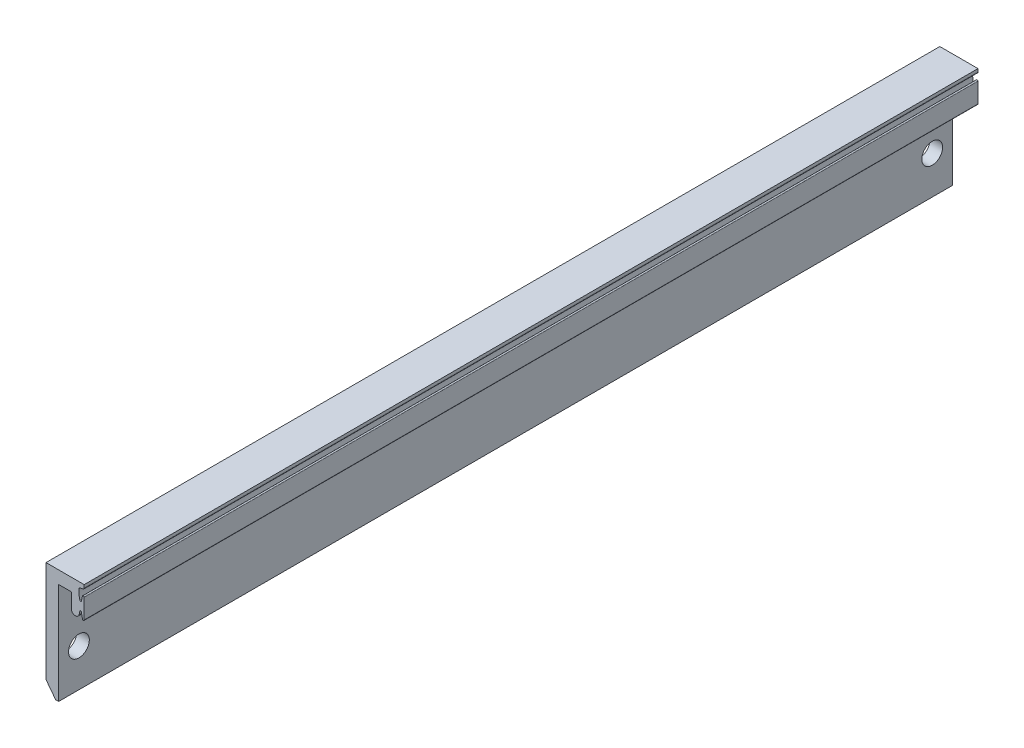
ISO-10303-21;
HEADER;
FILE_DESCRIPTION(('STEP AP214'),'2;1');
FILE_NAME('part.step','',(''),(''),'','','');
FILE_SCHEMA(('AUTOMOTIVE_DESIGN { 1 0 10303 214 1 1 1 1 }'));
ENDSEC;
DATA;
#1=APPLICATION_CONTEXT('core data for automotive mechanical design processes');
#2=APPLICATION_PROTOCOL_DEFINITION('international standard','automotive_design',2000,#1);
#3=PRODUCT_CONTEXT('',#1,'mechanical');
#4=PRODUCT('Part','Part','',(#3));
#5=PRODUCT_RELATED_PRODUCT_CATEGORY('part','',(#4));
#6=PRODUCT_DEFINITION_FORMATION('','',#4);
#7=PRODUCT_DEFINITION_CONTEXT('part definition',#1,'design');
#8=PRODUCT_DEFINITION('design','',#6,#7);
#9=PRODUCT_DEFINITION_SHAPE('','',#8);
#10=(LENGTH_UNIT() NAMED_UNIT(*) SI_UNIT(.MILLI.,.METRE.));
#11=(NAMED_UNIT(*) PLANE_ANGLE_UNIT() SI_UNIT($,.RADIAN.));
#12=(NAMED_UNIT(*) SI_UNIT($,.STERADIAN.) SOLID_ANGLE_UNIT());
#13=UNCERTAINTY_MEASURE_WITH_UNIT(LENGTH_MEASURE(1.E-05),#10,'distance_accuracy_value','');
#14=(GEOMETRIC_REPRESENTATION_CONTEXT(3) GLOBAL_UNCERTAINTY_ASSIGNED_CONTEXT((#13)) GLOBAL_UNIT_ASSIGNED_CONTEXT((#10,
#11,#12)) REPRESENTATION_CONTEXT('',''));
#15=CARTESIAN_POINT('',(0.,0.,0.));
#16=DIRECTION('',(0.,0.,1.));
#17=DIRECTION('',(1.,0.,0.));
#18=AXIS2_PLACEMENT_3D('',#15,#16,#17);
#19=CARTESIAN_POINT('',(2473.35258692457,1.1297441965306E-09,88.225));
#20=DIRECTION('',(1.,4.56766335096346E-13,0.));
#21=DIRECTION('',(-4.56766335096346E-13,1.,0.));
#22=AXIS2_PLACEMENT_3D('',#19,#20,#21);
#23=PLANE('',#22);
#24=DIRECTION('',(4.56766335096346E-13,-1.,0.));
#25=VECTOR('',#24,1.);
#26=CARTESIAN_POINT('',(2473.35258692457,1.1297441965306E-09,-88.225));
#27=LINE('',#26,#25);
#28=CARTESIAN_POINT('',(2473.35258692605,-3238.37710777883,-88.225));
#29=VERTEX_POINT('',#28);
#30=CARTESIAN_POINT('',(2473.35258692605,-3241.29384556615,-88.225));
#31=VERTEX_POINT('',#30);
#32=EDGE_CURVE('E213',#29,#31,#27,.T.);
#33=ORIENTED_EDGE('',*,*,#32,.T.);
#34=DIRECTION('',(0.,0.,-1.));
#35=VECTOR('',#34,1.);
#36=CARTESIAN_POINT('',(2473.35258692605,-3241.29384556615,88.225));
#37=LINE('',#36,#35);
#38=CARTESIAN_POINT('',(2473.35258692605,-3241.29384556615,88.225));
#39=VERTEX_POINT('',#38);
#40=EDGE_CURVE('E11',#39,#31,#37,.T.);
#41=ORIENTED_EDGE('',*,*,#40,.F.);
#42=DIRECTION('',(4.56766335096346E-13,-1.,0.));
#43=VECTOR('',#42,1.);
#44=CARTESIAN_POINT('',(2473.35258692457,1.1297441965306E-09,88.225));
#45=LINE('',#44,#43);
#46=CARTESIAN_POINT('',(2473.35258692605,-3238.37710777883,88.225));
#47=VERTEX_POINT('',#46);
#48=EDGE_CURVE('E267',#47,#39,#45,.T.);
#49=ORIENTED_EDGE('',*,*,#48,.F.);
#50=DIRECTION('',(0.,0.,-1.));
#51=VECTOR('',#50,1.);
#52=CARTESIAN_POINT('',(2473.35258692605,-3238.37710777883,88.225));
#53=LINE('',#52,#51);
#54=EDGE_CURVE('E209',#47,#29,#53,.T.);
#55=ORIENTED_EDGE('',*,*,#54,.T.);
#56=EDGE_LOOP('',(#33,#41,#49,#55));
#57=FACE_BOUND('',#56,.T.);
#58=ADVANCED_FACE('F39',(#57),#23,.F.);
#59=CARTESIAN_POINT('',(2474.13562881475,-3241.29384556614,88.225));
#60=DIRECTION('',(0.,0.,-1.));
#61=DIRECTION('',(-1.,0.,0.));
#62=AXIS2_PLACEMENT_3D('',#59,#60,#61);
#63=CYLINDRICAL_SURFACE('',#62,0.783041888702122);
#64=CARTESIAN_POINT('',(2474.13562881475,-3241.29384556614,-88.225));
#65=DIRECTION('',(0.,0.,1.));
#66=DIRECTION('',(1.,0.,0.));
#67=AXIS2_PLACEMENT_3D('',#64,#65,#66);
#68=CIRCLE('',#67,0.783041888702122);
#69=CARTESIAN_POINT('',(2474.90170185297,-3241.4559773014,-88.225));
#70=VERTEX_POINT('',#69);
#71=EDGE_CURVE('E216',#31,#70,#68,.T.);
#72=ORIENTED_EDGE('',*,*,#71,.T.);
#73=DIRECTION('',(0.,0.,-1.));
#74=VECTOR('',#73,1.);
#75=CARTESIAN_POINT('',(2474.90170185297,-3241.4559773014,88.225));
#76=LINE('',#75,#74);
#77=CARTESIAN_POINT('',(2474.90170185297,-3241.4559773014,88.225));
#78=VERTEX_POINT('',#77);
#79=EDGE_CURVE('E48',#78,#70,#76,.T.);
#80=ORIENTED_EDGE('',*,*,#79,.F.);
#81=CARTESIAN_POINT('',(2474.13562881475,-3241.29384556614,88.225));
#82=DIRECTION('',(0.,0.,1.));
#83=DIRECTION('',(1.,0.,0.));
#84=AXIS2_PLACEMENT_3D('',#81,#82,#83);
#85=CIRCLE('',#84,0.783041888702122);
#86=EDGE_CURVE('E135',#39,#78,#85,.T.);
#87=ORIENTED_EDGE('',*,*,#86,.F.);
#88=ORIENTED_EDGE('',*,*,#40,.T.);
#89=EDGE_LOOP('',(#72,#80,#87,#88));
#90=FACE_BOUND('',#89,.T.);
#91=ADVANCED_FACE('F385',(#90),#63,.T.);
#92=CARTESIAN_POINT('',(3025.41088073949,-640.298106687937,88.225));
#93=DIRECTION('',(-0.978329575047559,0.207053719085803,0.));
#94=DIRECTION('',(-0.207053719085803,-0.978329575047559,0.));
#95=AXIS2_PLACEMENT_3D('',#92,#93,#94);
#96=PLANE('',#95);
#97=DIRECTION('',(0.207053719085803,0.978329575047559,0.));
#98=VECTOR('',#97,1.);
#99=CARTESIAN_POINT('',(3025.41088073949,-640.298106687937,-88.225));
#100=LINE('',#99,#98);
#101=CARTESIAN_POINT('',(2475.03432887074,-3240.82931416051,-88.225));
#102=VERTEX_POINT('',#101);
#103=EDGE_CURVE('E219',#70,#102,#100,.T.);
#104=ORIENTED_EDGE('',*,*,#103,.T.);
#105=DIRECTION('',(0.,0.,-1.));
#106=VECTOR('',#105,1.);
#107=CARTESIAN_POINT('',(2475.03432887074,-3240.82931416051,88.225));
#108=LINE('',#107,#106);
#109=CARTESIAN_POINT('',(2475.03432887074,-3240.82931416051,88.225));
#110=VERTEX_POINT('',#109);
#111=EDGE_CURVE('E303',#110,#102,#108,.T.);
#112=ORIENTED_EDGE('',*,*,#111,.F.);
#113=DIRECTION('',(0.207053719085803,0.978329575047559,0.));
#114=VECTOR('',#113,1.);
#115=CARTESIAN_POINT('',(3025.41088073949,-640.298106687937,88.225));
#116=LINE('',#115,#114);
#117=EDGE_CURVE('E320',#78,#110,#116,.T.);
#118=ORIENTED_EDGE('',*,*,#117,.F.);
#119=ORIENTED_EDGE('',*,*,#79,.T.);
#120=EDGE_LOOP('',(#104,#112,#118,#119));
#121=FACE_BOUND('',#120,.T.);
#122=ADVANCED_FACE('F389',(#121),#96,.F.);
#123=CARTESIAN_POINT('',(2475.18258692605,-3240.85210777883,88.225));
#124=DIRECTION('',(0.,0.,-1.));
#125=DIRECTION('',(-1.,0.,0.));
#126=AXIS2_PLACEMENT_3D('',#123,#124,#125);
#127=CYLINDRICAL_SURFACE('',#126,0.149999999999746);
#128=CARTESIAN_POINT('',(2475.18258692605,-3240.85210777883,-88.225));
#129=DIRECTION('',(0.,0.,1.));
#130=DIRECTION('',(1.,0.,0.));
#131=AXIS2_PLACEMENT_3D('',#128,#129,#130);
#132=CIRCLE('',#131,0.149999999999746);
#133=CARTESIAN_POINT('',(2475.32961411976,-3240.82239239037,-88.225));
#134=VERTEX_POINT('',#133);
#135=EDGE_CURVE('E222',#134,#102,#132,.T.);
#136=ORIENTED_EDGE('',*,*,#135,.F.);
#137=DIRECTION('',(0.,0.,-1.));
#138=VECTOR('',#137,1.);
#139=CARTESIAN_POINT('',(2475.32961411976,-3240.82239239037,88.225));
#140=LINE('',#139,#138);
#141=CARTESIAN_POINT('',(2475.32961411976,-3240.82239239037,88.225));
#142=VERTEX_POINT('',#141);
#143=EDGE_CURVE('E301',#142,#134,#140,.T.);
#144=ORIENTED_EDGE('',*,*,#143,.F.);
#145=CARTESIAN_POINT('',(2475.18258692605,-3240.85210777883,88.225));
#146=DIRECTION('',(0.,0.,1.));
#147=DIRECTION('',(1.,0.,0.));
#148=AXIS2_PLACEMENT_3D('',#145,#146,#147);
#149=CIRCLE('',#148,0.149999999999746);
#150=EDGE_CURVE('E322',#142,#110,#149,.T.);
#151=ORIENTED_EDGE('',*,*,#150,.T.);
#152=ORIENTED_EDGE('',*,*,#111,.T.);
#153=EDGE_LOOP('',(#136,#144,#151,#152));
#154=FACE_BOUND('',#153,.T.);
#155=ADVANCED_FACE('F393',(#154),#127,.F.);
#156=CARTESIAN_POINT('',(1748.89480993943,353.465827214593,88.225));
#157=DIRECTION('',(0.980181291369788,0.19810258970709,0.));
#158=DIRECTION('',(-0.19810258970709,0.980181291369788,0.));
#159=AXIS2_PLACEMENT_3D('',#156,#157,#158);
#160=PLANE('',#159);
#161=DIRECTION('',(0.19810258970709,-0.980181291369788,0.));
#162=VECTOR('',#161,1.);
#163=CARTESIAN_POINT('',(1748.89480993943,353.465827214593,-88.225));
#164=LINE('',#163,#162);
#165=CARTESIAN_POINT('',(2475.55582897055,-3241.94166884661,-88.225));
#166=VERTEX_POINT('',#165);
#167=EDGE_CURVE('E225',#134,#166,#164,.T.);
#168=ORIENTED_EDGE('',*,*,#167,.T.);
#169=DIRECTION('',(0.,0.,-1.));
#170=VECTOR('',#169,1.);
#171=CARTESIAN_POINT('',(2475.55582897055,-3241.94166884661,88.225));
#172=LINE('',#171,#170);
#173=CARTESIAN_POINT('',(2475.55582897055,-3241.94166884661,88.225));
#174=VERTEX_POINT('',#173);
#175=EDGE_CURVE('E298',#174,#166,#172,.T.);
#176=ORIENTED_EDGE('',*,*,#175,.F.);
#177=DIRECTION('',(0.19810258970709,-0.980181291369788,0.));
#178=VECTOR('',#177,1.);
#179=CARTESIAN_POINT('',(1748.89480993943,353.465827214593,88.225));
#180=LINE('',#179,#178);
#181=EDGE_CURVE('E325',#142,#174,#180,.T.);
#182=ORIENTED_EDGE('',*,*,#181,.F.);
#183=ORIENTED_EDGE('',*,*,#143,.T.);
#184=EDGE_LOOP('',(#168,#176,#182,#183));
#185=FACE_BOUND('',#184,.T.);
#186=ADVANCED_FACE('F399',(#185),#160,.F.);
#187=CARTESIAN_POINT('',(2475.72258692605,-3241.90796571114,88.225));
#188=DIRECTION('',(0.,0.,-1.));
#189=DIRECTION('',(-1.,0.,0.));
#190=AXIS2_PLACEMENT_3D('',#187,#188,#189);
#191=CYLINDRICAL_SURFACE('',#190,0.17012970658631);
#192=CARTESIAN_POINT('',(2475.72258692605,-3241.90796571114,-88.225));
#193=DIRECTION('',(0.,0.,1.));
#194=DIRECTION('',(1.,0.,0.));
#195=AXIS2_PLACEMENT_3D('',#192,#193,#194);
#196=CIRCLE('',#195,0.17012970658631);
#197=CARTESIAN_POINT('',(2475.89258692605,-3241.90132364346,-88.225));
#198=VERTEX_POINT('',#197);
#199=EDGE_CURVE('E227',#166,#198,#196,.T.);
#200=ORIENTED_EDGE('',*,*,#199,.T.);
#201=DIRECTION('',(0.,0.,-1.));
#202=VECTOR('',#201,1.);
#203=CARTESIAN_POINT('',(2475.89258692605,-3241.90132364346,88.225));
#204=LINE('',#203,#202);
#205=CARTESIAN_POINT('',(2475.89258692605,-3241.90132364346,88.225));
#206=VERTEX_POINT('',#205);
#207=EDGE_CURVE('E296',#206,#198,#204,.T.);
#208=ORIENTED_EDGE('',*,*,#207,.F.);
#209=CARTESIAN_POINT('',(2475.72258692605,-3241.90796571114,88.225));
#210=DIRECTION('',(0.,0.,1.));
#211=DIRECTION('',(1.,0.,0.));
#212=AXIS2_PLACEMENT_3D('',#209,#210,#211);
#213=CIRCLE('',#212,0.17012970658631);
#214=EDGE_CURVE('E327',#174,#206,#213,.T.);
#215=ORIENTED_EDGE('',*,*,#214,.F.);
#216=ORIENTED_EDGE('',*,*,#175,.T.);
#217=EDGE_LOOP('',(#200,#208,#215,#216));
#218=FACE_BOUND('',#217,.T.);
#219=ADVANCED_FACE('F403',(#218),#191,.T.);
#220=CARTESIAN_POINT('',(2475.89258692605,0.,88.225));
#221=DIRECTION('',(1.,0.,0.));
#222=DIRECTION('',(0.,0.,-1.));
#223=AXIS2_PLACEMENT_3D('',#220,#221,#222);
#224=PLANE('',#223);
#225=DIRECTION('',(0.,-1.,0.));
#226=VECTOR('',#225,1.);
#227=CARTESIAN_POINT('',(2475.89258692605,0.,-88.225));
#228=LINE('',#227,#226);
#229=CARTESIAN_POINT('',(2475.89258692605,-3238.03960777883,-88.225));
#230=VERTEX_POINT('',#229);
#231=EDGE_CURVE('E230',#230,#198,#228,.T.);
#232=ORIENTED_EDGE('',*,*,#231,.F.);
#233=DIRECTION('',(0.,0.,-1.));
#234=VECTOR('',#233,1.);
#235=CARTESIAN_POINT('',(2475.89258692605,-3238.03960777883,88.225));
#236=LINE('',#235,#234);
#237=CARTESIAN_POINT('',(2475.89258692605,-3238.03960777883,88.225));
#238=VERTEX_POINT('',#237);
#239=EDGE_CURVE('E294',#238,#230,#236,.T.);
#240=ORIENTED_EDGE('',*,*,#239,.F.);
#241=DIRECTION('',(0.,-1.,0.));
#242=VECTOR('',#241,1.);
#243=CARTESIAN_POINT('',(2475.89258692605,0.,88.225));
#244=LINE('',#243,#242);
#245=EDGE_CURVE('E329',#238,#206,#244,.T.);
#246=ORIENTED_EDGE('',*,*,#245,.T.);
#247=ORIENTED_EDGE('',*,*,#207,.T.);
#248=EDGE_LOOP('',(#232,#240,#246,#247));
#249=FACE_BOUND('',#248,.T.);
#250=ADVANCED_FACE('F407',(#249),#224,.T.);
#251=CARTESIAN_POINT('',(2475.72258692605,-3238.04624984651,88.225));
#252=DIRECTION('',(0.,0.,-1.));
#253=DIRECTION('',(-1.,0.,0.));
#254=AXIS2_PLACEMENT_3D('',#251,#252,#253);
#255=CYLINDRICAL_SURFACE('',#254,0.17012970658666);
#256=CARTESIAN_POINT('',(2475.72258692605,-3238.04624984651,-88.225));
#257=DIRECTION('',(0.,0.,1.));
#258=DIRECTION('',(1.,0.,0.));
#259=AXIS2_PLACEMENT_3D('',#256,#257,#258);
#260=CIRCLE('',#259,0.17012970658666);
#261=CARTESIAN_POINT('',(2475.55690402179,-3238.00760670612,-88.225));
#262=VERTEX_POINT('',#261);
#263=EDGE_CURVE('E233',#230,#262,#260,.T.);
#264=ORIENTED_EDGE('',*,*,#263,.T.);
#265=DIRECTION('',(0.,0.,-1.));
#266=VECTOR('',#265,1.);
#267=CARTESIAN_POINT('',(2475.55690402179,-3238.00760670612,88.225));
#268=LINE('',#267,#266);
#269=CARTESIAN_POINT('',(2475.55690402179,-3238.00760670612,88.225));
#270=VERTEX_POINT('',#269);
#271=EDGE_CURVE('E291',#270,#262,#268,.T.);
#272=ORIENTED_EDGE('',*,*,#271,.F.);
#273=CARTESIAN_POINT('',(2475.72258692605,-3238.04624984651,88.225));
#274=DIRECTION('',(0.,0.,1.));
#275=DIRECTION('',(1.,0.,0.));
#276=AXIS2_PLACEMENT_3D('',#273,#274,#275);
#277=CIRCLE('',#276,0.17012970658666);
#278=EDGE_CURVE('E332',#238,#270,#277,.T.);
#279=ORIENTED_EDGE('',*,*,#278,.F.);
#280=ORIENTED_EDGE('',*,*,#239,.T.);
#281=EDGE_LOOP('',(#264,#272,#279,#280));
#282=FACE_BOUND('',#281,.T.);
#283=ADVANCED_FACE('F411',(#282),#255,.T.);
#284=CARTESIAN_POINT('',(3064.09234392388,-714.655209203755,88.225));
#285=DIRECTION('',(0.973862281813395,-0.227139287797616,0.));
#286=DIRECTION('',(0.227139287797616,0.973862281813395,0.));
#287=AXIS2_PLACEMENT_3D('',#284,#285,#286);
#288=PLANE('',#287);
#289=DIRECTION('',(-0.227139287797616,-0.973862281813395,0.));
#290=VECTOR('',#289,1.);
#291=CARTESIAN_POINT('',(3064.09234392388,-714.655209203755,-88.225));
#292=LINE('',#291,#290);
#293=CARTESIAN_POINT('',(2475.32866626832,-3238.986178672,-88.225));
#294=VERTEX_POINT('',#293);
#295=EDGE_CURVE('E235',#262,#294,#292,.T.);
#296=ORIENTED_EDGE('',*,*,#295,.T.);
#297=DIRECTION('',(0.,0.,-1.));
#298=VECTOR('',#297,1.);
#299=CARTESIAN_POINT('',(2475.32866626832,-3238.986178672,88.225));
#300=LINE('',#299,#298);
#301=CARTESIAN_POINT('',(2475.32866626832,-3238.986178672,88.225));
#302=VERTEX_POINT('',#301);
#303=EDGE_CURVE('E289',#302,#294,#300,.T.);
#304=ORIENTED_EDGE('',*,*,#303,.F.);
#305=DIRECTION('',(-0.227139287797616,-0.973862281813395,0.));
#306=VECTOR('',#305,1.);
#307=CARTESIAN_POINT('',(3064.09234392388,-714.655209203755,88.225));
#308=LINE('',#307,#306);
#309=EDGE_CURVE('E334',#270,#302,#308,.T.);
#310=ORIENTED_EDGE('',*,*,#309,.F.);
#311=ORIENTED_EDGE('',*,*,#271,.T.);
#312=EDGE_LOOP('',(#296,#304,#310,#311));
#313=FACE_BOUND('',#312,.T.);
#314=ADVANCED_FACE('F415',(#313),#288,.F.);
#315=CARTESIAN_POINT('',(2475.18258692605,-3238.95210777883,88.225));
#316=DIRECTION('',(0.,0.,-1.));
#317=DIRECTION('',(-1.,0.,0.));
#318=AXIS2_PLACEMENT_3D('',#315,#316,#317);
#319=CYLINDRICAL_SURFACE('',#318,0.150000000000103);
#320=CARTESIAN_POINT('',(2475.18258692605,-3238.95210777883,-88.225));
#321=DIRECTION('',(0.,0.,1.));
#322=DIRECTION('',(1.,0.,0.));
#323=AXIS2_PLACEMENT_3D('',#320,#321,#322);
#324=CIRCLE('',#323,0.150000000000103);
#325=CARTESIAN_POINT('',(2475.03361058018,-3238.96960201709,-88.225));
#326=VERTEX_POINT('',#325);
#327=EDGE_CURVE('E238',#326,#294,#324,.T.);
#328=ORIENTED_EDGE('',*,*,#327,.F.);
#329=DIRECTION('',(0.,0.,-1.));
#330=VECTOR('',#329,1.);
#331=CARTESIAN_POINT('',(2475.03361058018,-3238.96960201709,88.225));
#332=LINE('',#331,#330);
#333=CARTESIAN_POINT('',(2475.03361058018,-3238.96960201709,88.225));
#334=VERTEX_POINT('',#333);
#335=EDGE_CURVE('E287',#334,#326,#332,.T.);
#336=ORIENTED_EDGE('',*,*,#335,.F.);
#337=CARTESIAN_POINT('',(2475.18258692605,-3238.95210777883,88.225));
#338=DIRECTION('',(0.,0.,1.));
#339=DIRECTION('',(1.,0.,0.));
#340=AXIS2_PLACEMENT_3D('',#337,#338,#339);
#341=CIRCLE('',#340,0.150000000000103);
#342=EDGE_CURVE('E336',#334,#302,#341,.T.);
#343=ORIENTED_EDGE('',*,*,#342,.T.);
#344=ORIENTED_EDGE('',*,*,#303,.T.);
#345=EDGE_LOOP('',(#328,#336,#343,#344));
#346=FACE_BOUND('',#345,.T.);
#347=ADVANCED_FACE('F419',(#346),#319,.F.);
#348=CARTESIAN_POINT('',(2481.28067168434,-3237.37963252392,88.225));
#349=DIRECTION('',(0.,0.,-1.));
#350=DIRECTION('',(-1.,0.,0.));
#351=AXIS2_PLACEMENT_3D('',#348,#349,#350);
#352=CYLINDRICAL_SURFACE('',#351,6.44622179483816);
#353=CARTESIAN_POINT('',(2481.28067168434,-3237.37963252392,-88.225));
#354=DIRECTION('',(0.,0.,1.));
#355=DIRECTION('',(1.,0.,0.));
#356=AXIS2_PLACEMENT_3D('',#353,#354,#355);
#357=CIRCLE('',#356,6.44622179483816);
#358=CARTESIAN_POINT('',(2474.83964363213,-3237.12091828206,-88.225));
#359=VERTEX_POINT('',#358);
#360=EDGE_CURVE('E241',#359,#326,#357,.T.);
#361=ORIENTED_EDGE('',*,*,#360,.F.);
#362=DIRECTION('',(0.,0.,-1.));
#363=VECTOR('',#362,1.);
#364=CARTESIAN_POINT('',(2474.83964363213,-3237.12091828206,88.225));
#365=LINE('',#364,#363);
#366=CARTESIAN_POINT('',(2474.83964363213,-3237.12091828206,88.225));
#367=VERTEX_POINT('',#366);
#368=EDGE_CURVE('E285',#367,#359,#365,.T.);
#369=ORIENTED_EDGE('',*,*,#368,.F.);
#370=CARTESIAN_POINT('',(2481.28067168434,-3237.37963252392,88.225));
#371=DIRECTION('',(0.,0.,1.));
#372=DIRECTION('',(1.,0.,0.));
#373=AXIS2_PLACEMENT_3D('',#370,#371,#372);
#374=CIRCLE('',#373,6.44622179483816);
#375=EDGE_CURVE('E339',#367,#334,#374,.T.);
#376=ORIENTED_EDGE('',*,*,#375,.T.);
#377=ORIENTED_EDGE('',*,*,#335,.T.);
#378=EDGE_LOOP('',(#361,#369,#376,#377));
#379=FACE_BOUND('',#378,.T.);
#380=ADVANCED_FACE('F423',(#379),#352,.F.);
#381=CARTESIAN_POINT('',(2475.13940192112,-3237.13295855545,88.225));
#382=DIRECTION('',(0.,0.,-1.));
#383=DIRECTION('',(-1.,0.,0.));
#384=AXIS2_PLACEMENT_3D('',#381,#382,#383);
#385=CYLINDRICAL_SURFACE('',#384,0.299999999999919);
#386=CARTESIAN_POINT('',(2475.13940192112,-3237.13295855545,-88.225));
#387=DIRECTION('',(0.,0.,1.));
#388=DIRECTION('',(1.,0.,0.));
#389=AXIS2_PLACEMENT_3D('',#386,#387,#388);
#390=CIRCLE('',#389,0.299999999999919);
#391=CARTESIAN_POINT('',(2475.09145484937,-3236.83681487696,-88.225));
#392=VERTEX_POINT('',#391);
#393=EDGE_CURVE('E244',#392,#359,#390,.T.);
#394=ORIENTED_EDGE('',*,*,#393,.F.);
#395=DIRECTION('',(0.,0.,-1.));
#396=VECTOR('',#395,1.);
#397=CARTESIAN_POINT('',(2475.09145484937,-3236.83681487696,88.225));
#398=LINE('',#397,#396);
#399=CARTESIAN_POINT('',(2475.09145484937,-3236.83681487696,88.225));
#400=VERTEX_POINT('',#399);
#401=EDGE_CURVE('E283',#400,#392,#398,.T.);
#402=ORIENTED_EDGE('',*,*,#401,.F.);
#403=CARTESIAN_POINT('',(2475.13940192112,-3237.13295855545,88.225));
#404=DIRECTION('',(0.,0.,1.));
#405=DIRECTION('',(1.,0.,0.));
#406=AXIS2_PLACEMENT_3D('',#403,#404,#405);
#407=CIRCLE('',#406,0.299999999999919);
#408=EDGE_CURVE('E342',#400,#367,#407,.T.);
#409=ORIENTED_EDGE('',*,*,#408,.T.);
#410=ORIENTED_EDGE('',*,*,#368,.T.);
#411=EDGE_LOOP('',(#394,#402,#409,#410));
#412=FACE_BOUND('',#411,.T.);
#413=ADVANCED_FACE('F427',(#412),#385,.F.);
#414=CARTESIAN_POINT('',(573.895628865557,-3544.64947241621,88.225));
#415=DIRECTION('',(-0.159823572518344,0.987145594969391,0.));
#416=DIRECTION('',(-0.987145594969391,-0.159823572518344,0.));
#417=AXIS2_PLACEMENT_3D('',#414,#415,#416);
#418=PLANE('',#417);
#419=DIRECTION('',(0.987145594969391,0.159823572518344,0.));
#420=VECTOR('',#419,1.);
#421=CARTESIAN_POINT('',(573.895628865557,-3544.64947241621,-88.225));
#422=LINE('',#421,#420);
#423=CARTESIAN_POINT('',(2475.64053399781,-3236.74791634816,-88.225));
#424=VERTEX_POINT('',#423);
#425=EDGE_CURVE('E247',#392,#424,#422,.T.);
#426=ORIENTED_EDGE('',*,*,#425,.T.);
#427=DIRECTION('',(0.,0.,-1.));
#428=VECTOR('',#427,1.);
#429=CARTESIAN_POINT('',(2475.64053399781,-3236.74791634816,88.225));
#430=LINE('',#429,#428);
#431=CARTESIAN_POINT('',(2475.64053399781,-3236.74791634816,88.225));
#432=VERTEX_POINT('',#431);
#433=EDGE_CURVE('E280',#432,#424,#430,.T.);
#434=ORIENTED_EDGE('',*,*,#433,.F.);
#435=DIRECTION('',(0.987145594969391,0.159823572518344,0.));
#436=VECTOR('',#435,1.);
#437=CARTESIAN_POINT('',(573.895628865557,-3544.64947241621,88.225));
#438=LINE('',#437,#436);
#439=EDGE_CURVE('E345',#400,#432,#438,.T.);
#440=ORIENTED_EDGE('',*,*,#439,.F.);
#441=ORIENTED_EDGE('',*,*,#401,.T.);
#442=EDGE_LOOP('',(#426,#434,#440,#441));
#443=FACE_BOUND('',#442,.T.);
#444=ADVANCED_FACE('F431',(#443),#418,.F.);
#445=CARTESIAN_POINT('',(2475.59258692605,-3236.45177266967,88.225));
#446=DIRECTION('',(0.,0.,-1.));
#447=DIRECTION('',(-1.,0.,0.));
#448=AXIS2_PLACEMENT_3D('',#445,#446,#447);
#449=CYLINDRICAL_SURFACE('',#448,0.299999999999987);
#450=CARTESIAN_POINT('',(2475.59258692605,-3236.45177266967,-88.225));
#451=DIRECTION('',(0.,0.,1.));
#452=DIRECTION('',(1.,0.,0.));
#453=AXIS2_PLACEMENT_3D('',#450,#451,#452);
#454=CIRCLE('',#453,0.299999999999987);
#455=CARTESIAN_POINT('',(2475.89258692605,-3236.45177266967,-88.225));
#456=VERTEX_POINT('',#455);
#457=EDGE_CURVE('E249',#424,#456,#454,.T.);
#458=ORIENTED_EDGE('',*,*,#457,.T.);
#459=DIRECTION('',(0.,0.,-1.));
#460=VECTOR('',#459,1.);
#461=CARTESIAN_POINT('',(2475.89258692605,-3236.45177266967,88.225));
#462=LINE('',#461,#460);
#463=CARTESIAN_POINT('',(2475.89258692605,-3236.45177266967,88.225));
#464=VERTEX_POINT('',#463);
#465=EDGE_CURVE('E278',#464,#456,#462,.T.);
#466=ORIENTED_EDGE('',*,*,#465,.F.);
#467=CARTESIAN_POINT('',(2475.59258692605,-3236.45177266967,88.225));
#468=DIRECTION('',(0.,0.,1.));
#469=DIRECTION('',(1.,0.,0.));
#470=AXIS2_PLACEMENT_3D('',#467,#468,#469);
#471=CIRCLE('',#470,0.299999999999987);
#472=EDGE_CURVE('E347',#432,#464,#471,.T.);
#473=ORIENTED_EDGE('',*,*,#472,.F.);
#474=ORIENTED_EDGE('',*,*,#433,.T.);
#475=EDGE_LOOP('',(#458,#466,#473,#474));
#476=FACE_BOUND('',#475,.T.);
#477=ADVANCED_FACE('F435',(#476),#449,.T.);
#478=CARTESIAN_POINT('',(2475.89258693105,-3.82663775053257E-09,88.225));
#479=DIRECTION('',(1.,-1.54555887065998E-12,0.));
#480=DIRECTION('',(1.54555887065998E-12,1.,0.));
#481=AXIS2_PLACEMENT_3D('',#478,#479,#480);
#482=PLANE('',#481);
#483=DIRECTION('',(-1.54555887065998E-12,-1.,0.));
#484=VECTOR('',#483,1.);
#485=CARTESIAN_POINT('',(2475.89258693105,-3.82663775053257E-09,-88.225));
#486=LINE('',#485,#484);
#487=CARTESIAN_POINT('',(2475.89258692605,-3235.87710777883,-88.225));
#488=VERTEX_POINT('',#487);
#489=EDGE_CURVE('E252',#488,#456,#486,.T.);
#490=ORIENTED_EDGE('',*,*,#489,.F.);
#491=DIRECTION('',(0.,0.,-1.));
#492=VECTOR('',#491,1.);
#493=CARTESIAN_POINT('',(2475.89258692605,-3235.87710777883,88.225));
#494=LINE('',#493,#492);
#495=CARTESIAN_POINT('',(2475.89258692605,-3235.87710777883,88.225));
#496=VERTEX_POINT('',#495);
#497=EDGE_CURVE('E276',#496,#488,#494,.T.);
#498=ORIENTED_EDGE('',*,*,#497,.F.);
#499=DIRECTION('',(-1.54555887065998E-12,-1.,0.));
#500=VECTOR('',#499,1.);
#501=CARTESIAN_POINT('',(2475.89258693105,-3.82663775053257E-09,88.225));
#502=LINE('',#501,#500);
#503=EDGE_CURVE('E349',#496,#464,#502,.T.);
#504=ORIENTED_EDGE('',*,*,#503,.T.);
#505=ORIENTED_EDGE('',*,*,#465,.T.);
#506=EDGE_LOOP('',(#490,#498,#504,#505));
#507=FACE_BOUND('',#506,.T.);
#508=ADVANCED_FACE('F439',(#507),#482,.T.);
#509=CARTESIAN_POINT('',(0.,-3235.87710777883,88.225));
#510=DIRECTION('',(0.,1.,0.));
#511=DIRECTION('',(0.,0.,1.));
#512=AXIS2_PLACEMENT_3D('',#509,#510,#511);
#513=PLANE('',#512);
#514=DIRECTION('',(1.,0.,0.));
#515=VECTOR('',#514,1.);
#516=CARTESIAN_POINT('',(0.,-3235.87710777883,-88.225));
#517=LINE('',#516,#515);
#518=CARTESIAN_POINT('',(2468.35258692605,-3235.87710777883,-88.225));
#519=VERTEX_POINT('',#518);
#520=EDGE_CURVE('E255',#519,#488,#517,.T.);
#521=ORIENTED_EDGE('',*,*,#520,.F.);
#522=DIRECTION('',(0.,0.,-1.));
#523=VECTOR('',#522,1.);
#524=CARTESIAN_POINT('',(2468.35258692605,-3235.87710777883,88.225));
#525=LINE('',#524,#523);
#526=CARTESIAN_POINT('',(2468.35258692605,-3235.87710777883,88.225));
#527=VERTEX_POINT('',#526);
#528=EDGE_CURVE('E274',#527,#519,#525,.T.);
#529=ORIENTED_EDGE('',*,*,#528,.F.);
#530=DIRECTION('',(1.,0.,0.));
#531=VECTOR('',#530,1.);
#532=CARTESIAN_POINT('',(0.,-3235.87710777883,88.225));
#533=LINE('',#532,#531);
#534=EDGE_CURVE('E352',#527,#496,#533,.T.);
#535=ORIENTED_EDGE('',*,*,#534,.T.);
#536=ORIENTED_EDGE('',*,*,#497,.T.);
#537=EDGE_LOOP('',(#521,#529,#535,#536));
#538=FACE_BOUND('',#537,.T.);
#539=ADVANCED_FACE('F443',(#538),#513,.T.);
#540=CARTESIAN_POINT('',(2468.35258692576,2.19233749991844E-10,88.225));
#541=DIRECTION('',(1.,0.,0.));
#542=DIRECTION('',(0.,1.,0.));
#543=AXIS2_PLACEMENT_3D('',#540,#541,#542);
#544=PLANE('',#543);
#545=CARTESIAN_POINT('',(2468.35258692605,-3250.87710777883,84.225));
#546=DIRECTION('',(-1.,0.,0.));
#547=DIRECTION('',(0.,1.,0.));
#548=AXIS2_PLACEMENT_3D('',#545,#546,#547);
#549=CIRCLE('',#548,2.04999999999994);
#550=CARTESIAN_POINT('',(2468.35258692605,-3248.82710777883,84.225));
#551=VERTEX_POINT('',#550);
#552=EDGE_CURVE('E315',#551,#551,#549,.T.);
#553=ORIENTED_EDGE('',*,*,#552,.F.);
#554=EDGE_LOOP('',(#553));
#555=FACE_BOUND('',#554,.T.);
#556=CARTESIAN_POINT('',(2468.35258692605,-3250.87710777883,-84.225));
#557=DIRECTION('',(-1.,0.,0.));
#558=DIRECTION('',(0.,-1.,0.));
#559=AXIS2_PLACEMENT_3D('',#556,#557,#558);
#560=CIRCLE('',#559,2.04999999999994);
#561=CARTESIAN_POINT('',(2468.35258692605,-3252.92710777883,-84.225));
#562=VERTEX_POINT('',#561);
#563=EDGE_CURVE('E307',#562,#562,#560,.T.);
#564=ORIENTED_EDGE('',*,*,#563,.F.);
#565=EDGE_LOOP('',(#564));
#566=FACE_BOUND('',#565,.T.);
#567=DIRECTION('',(0.,-1.,0.));
#568=VECTOR('',#567,1.);
#569=CARTESIAN_POINT('',(2468.35258692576,2.19233749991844E-10,-88.225));
#570=LINE('',#569,#568);
#571=CARTESIAN_POINT('',(2468.35258692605,-3255.87710777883,-88.225));
#572=VERTEX_POINT('',#571);
#573=EDGE_CURVE('E258',#519,#572,#570,.T.);
#574=ORIENTED_EDGE('',*,*,#573,.T.);
#575=DIRECTION('',(0.,0.,-1.));
#576=VECTOR('',#575,1.);
#577=CARTESIAN_POINT('',(2468.35258692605,-3255.87710777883,88.225));
#578=LINE('',#577,#576);
#579=CARTESIAN_POINT('',(2468.35258692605,-3255.87710777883,88.225));
#580=VERTEX_POINT('',#579);
#581=EDGE_CURVE('E271',#580,#572,#578,.T.);
#582=ORIENTED_EDGE('',*,*,#581,.F.);
#583=DIRECTION('',(0.,-1.,0.));
#584=VECTOR('',#583,1.);
#585=CARTESIAN_POINT('',(2468.35258692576,2.19233749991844E-10,88.225));
#586=LINE('',#585,#584);
#587=EDGE_CURVE('E355',#527,#580,#586,.T.);
#588=ORIENTED_EDGE('',*,*,#587,.F.);
#589=ORIENTED_EDGE('',*,*,#528,.T.);
#590=EDGE_LOOP('',(#574,#582,#588,#589));
#591=FACE_BOUND('',#590,.T.);
#592=ADVANCED_FACE('F361',(#555,#566,#591),#544,.F.);
#593=CARTESIAN_POINT('',(-3.87551659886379,-2.94539261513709,88.225));
#594=DIRECTION('',(0.796162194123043,0.605083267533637,0.));
#595=DIRECTION('',(-0.605083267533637,0.796162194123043,0.));
#596=AXIS2_PLACEMENT_3D('',#593,#594,#595);
#597=PLANE('',#596);
#598=DIRECTION('',(0.605083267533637,-0.796162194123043,0.));
#599=VECTOR('',#598,1.);
#600=CARTESIAN_POINT('',(-3.87551659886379,-2.94539261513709,-88.225));
#601=LINE('',#600,#599);
#602=CARTESIAN_POINT('',(2470.25258692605,-3258.37710777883,-88.225));
#603=VERTEX_POINT('',#602);
#604=EDGE_CURVE('E260',#572,#603,#601,.T.);
#605=ORIENTED_EDGE('',*,*,#604,.T.);
#606=DIRECTION('',(0.,0.,-1.));
#607=VECTOR('',#606,1.);
#608=CARTESIAN_POINT('',(2470.25258692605,-3258.37710777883,88.225));
#609=LINE('',#608,#607);
#610=CARTESIAN_POINT('',(2470.25258692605,-3258.37710777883,88.225));
#611=VERTEX_POINT('',#610);
#612=EDGE_CURVE('E199',#611,#603,#609,.T.);
#613=ORIENTED_EDGE('',*,*,#612,.F.);
#614=DIRECTION('',(0.605083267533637,-0.796162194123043,0.));
#615=VECTOR('',#614,1.);
#616=CARTESIAN_POINT('',(-3.87551659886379,-2.94539261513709,88.225));
#617=LINE('',#616,#615);
#618=EDGE_CURVE('E204',#580,#611,#617,.T.);
#619=ORIENTED_EDGE('',*,*,#618,.F.);
#620=ORIENTED_EDGE('',*,*,#581,.T.);
#621=EDGE_LOOP('',(#605,#613,#619,#620));
#622=FACE_BOUND('',#621,.T.);
#623=ADVANCED_FACE('F365',(#622),#597,.F.);
#624=CARTESIAN_POINT('',(0.,-3258.37710777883,88.225));
#625=DIRECTION('',(0.,-1.,0.));
#626=DIRECTION('',(0.,0.,-1.));
#627=AXIS2_PLACEMENT_3D('',#624,#625,#626);
#628=PLANE('',#627);
#629=DIRECTION('',(-1.,0.,0.));
#630=VECTOR('',#629,1.);
#631=CARTESIAN_POINT('',(0.,-3258.37710777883,-88.225));
#632=LINE('',#631,#630);
#633=CARTESIAN_POINT('',(2470.85258692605,-3258.37710777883,-88.225));
#634=VERTEX_POINT('',#633);
#635=EDGE_CURVE('E194',#634,#603,#632,.T.);
#636=ORIENTED_EDGE('',*,*,#635,.F.);
#637=DIRECTION('',(0.,0.,-1.));
#638=VECTOR('',#637,1.);
#639=CARTESIAN_POINT('',(2470.85258692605,-3258.37710777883,88.225));
#640=LINE('',#639,#638);
#641=CARTESIAN_POINT('',(2470.85258692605,-3258.37710777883,88.225));
#642=VERTEX_POINT('',#641);
#643=EDGE_CURVE('E189',#642,#634,#640,.T.);
#644=ORIENTED_EDGE('',*,*,#643,.F.);
#645=DIRECTION('',(-1.,0.,0.));
#646=VECTOR('',#645,1.);
#647=CARTESIAN_POINT('',(0.,-3258.37710777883,88.225));
#648=LINE('',#647,#646);
#649=EDGE_CURVE('E192',#642,#611,#648,.T.);
#650=ORIENTED_EDGE('',*,*,#649,.T.);
#651=ORIENTED_EDGE('',*,*,#612,.T.);
#652=EDGE_LOOP('',(#636,#644,#650,#651));
#653=FACE_BOUND('',#652,.T.);
#654=ADVANCED_FACE('F191',(#653),#628,.T.);
#655=CARTESIAN_POINT('',(2470.85258692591,1.09727897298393E-10,88.225));
#656=DIRECTION('',(1.,0.,0.));
#657=DIRECTION('',(0.,1.,0.));
#658=AXIS2_PLACEMENT_3D('',#655,#656,#657);
#659=PLANE('',#658);
#660=CARTESIAN_POINT('',(2470.85258692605,-3250.87710777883,84.225));
#661=DIRECTION('',(1.,0.,0.));
#662=DIRECTION('',(0.,1.,0.));
#663=AXIS2_PLACEMENT_3D('',#660,#661,#662);
#664=CIRCLE('',#663,2.04999999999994);
#665=CARTESIAN_POINT('',(2470.85258692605,-3248.82710777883,84.225));
#666=VERTEX_POINT('',#665);
#667=EDGE_CURVE('E42',#666,#666,#664,.T.);
#668=ORIENTED_EDGE('',*,*,#667,.F.);
#669=EDGE_LOOP('',(#668));
#670=FACE_BOUND('',#669,.T.);
#671=CARTESIAN_POINT('',(2470.85258692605,-3250.87710777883,-84.225));
#672=DIRECTION('',(1.,0.,0.));
#673=DIRECTION('',(0.,1.,0.));
#674=AXIS2_PLACEMENT_3D('',#671,#672,#673);
#675=CIRCLE('',#674,2.04999999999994);
#676=CARTESIAN_POINT('',(2470.85258692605,-3248.82710777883,-84.225));
#677=VERTEX_POINT('',#676);
#678=EDGE_CURVE('E217',#677,#677,#675,.T.);
#679=ORIENTED_EDGE('',*,*,#678,.F.);
#680=EDGE_LOOP('',(#679));
#681=FACE_BOUND('',#680,.T.);
#682=DIRECTION('',(0.,-1.,0.));
#683=VECTOR('',#682,1.);
#684=CARTESIAN_POINT('',(2470.85258692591,1.09727897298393E-10,-88.225));
#685=LINE('',#684,#683);
#686=CARTESIAN_POINT('',(2470.85258692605,-3238.37710777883,-88.225));
#687=VERTEX_POINT('',#686);
#688=EDGE_CURVE('E264',#687,#634,#685,.T.);
#689=ORIENTED_EDGE('',*,*,#688,.F.);
#690=DIRECTION('',(0.,0.,-1.));
#691=VECTOR('',#690,1.);
#692=CARTESIAN_POINT('',(2470.85258692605,-3238.37710777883,88.225));
#693=LINE('',#692,#691);
#694=CARTESIAN_POINT('',(2470.85258692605,-3238.37710777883,88.225));
#695=VERTEX_POINT('',#694);
#696=EDGE_CURVE('E124',#695,#687,#693,.T.);
#697=ORIENTED_EDGE('',*,*,#696,.F.);
#698=DIRECTION('',(0.,-1.,0.));
#699=VECTOR('',#698,1.);
#700=CARTESIAN_POINT('',(2470.85258692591,1.09727897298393E-10,88.225));
#701=LINE('',#700,#699);
#702=EDGE_CURVE('E202',#695,#642,#701,.T.);
#703=ORIENTED_EDGE('',*,*,#702,.T.);
#704=ORIENTED_EDGE('',*,*,#643,.T.);
#705=EDGE_LOOP('',(#689,#697,#703,#704));
#706=FACE_BOUND('',#705,.T.);
#707=ADVANCED_FACE('F207',(#670,#681,#706),#659,.T.);
#708=CARTESIAN_POINT('',(0.,-3238.37710777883,88.225));
#709=DIRECTION('',(0.,1.,0.));
#710=DIRECTION('',(0.,0.,1.));
#711=AXIS2_PLACEMENT_3D('',#708,#709,#710);
#712=PLANE('',#711);
#713=DIRECTION('',(1.,0.,0.));
#714=VECTOR('',#713,1.);
#715=CARTESIAN_POINT('',(0.,-3238.37710777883,-88.225));
#716=LINE('',#715,#714);
#717=EDGE_CURVE('E127',#687,#29,#716,.T.);
#718=ORIENTED_EDGE('',*,*,#717,.T.);
#719=ORIENTED_EDGE('',*,*,#54,.F.);
#720=DIRECTION('',(1.,0.,0.));
#721=VECTOR('',#720,1.);
#722=CARTESIAN_POINT('',(0.,-3238.37710777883,88.225));
#723=LINE('',#722,#721);
#724=EDGE_CURVE('E57',#695,#47,#723,.T.);
#725=ORIENTED_EDGE('',*,*,#724,.F.);
#726=ORIENTED_EDGE('',*,*,#696,.T.);
#727=EDGE_LOOP('',(#718,#719,#725,#726));
#728=FACE_BOUND('',#727,.T.);
#729=ADVANCED_FACE('F373',(#728),#712,.F.);
#730=CARTESIAN_POINT('',(0.,0.,88.225));
#731=DIRECTION('',(0.,0.,1.));
#732=DIRECTION('',(1.,0.,0.));
#733=AXIS2_PLACEMENT_3D('',#730,#731,#732);
#734=PLANE('',#733);
#735=ORIENTED_EDGE('',*,*,#48,.T.);
#736=ORIENTED_EDGE('',*,*,#86,.T.);
#737=ORIENTED_EDGE('',*,*,#117,.T.);
#738=ORIENTED_EDGE('',*,*,#150,.F.);
#739=ORIENTED_EDGE('',*,*,#181,.T.);
#740=ORIENTED_EDGE('',*,*,#214,.T.);
#741=ORIENTED_EDGE('',*,*,#245,.F.);
#742=ORIENTED_EDGE('',*,*,#278,.T.);
#743=ORIENTED_EDGE('',*,*,#309,.T.);
#744=ORIENTED_EDGE('',*,*,#342,.F.);
#745=ORIENTED_EDGE('',*,*,#375,.F.);
#746=ORIENTED_EDGE('',*,*,#408,.F.);
#747=ORIENTED_EDGE('',*,*,#439,.T.);
#748=ORIENTED_EDGE('',*,*,#472,.T.);
#749=ORIENTED_EDGE('',*,*,#503,.F.);
#750=ORIENTED_EDGE('',*,*,#534,.F.);
#751=ORIENTED_EDGE('',*,*,#587,.T.);
#752=ORIENTED_EDGE('',*,*,#618,.T.);
#753=ORIENTED_EDGE('',*,*,#649,.F.);
#754=ORIENTED_EDGE('',*,*,#702,.F.);
#755=ORIENTED_EDGE('',*,*,#724,.T.);
#756=EDGE_LOOP('',(#735,#736,#737,#738,#739,#740,#741,#742,#743,#744,#745,#746,#747,#748,#749,
#750,#751,#752,#753,#754,#755));
#757=FACE_BOUND('',#756,.T.);
#758=ADVANCED_FACE('F201',(#757),#734,.T.);
#759=CARTESIAN_POINT('',(0.,0.,-88.225));
#760=DIRECTION('',(0.,0.,1.));
#761=DIRECTION('',(1.,0.,0.));
#762=AXIS2_PLACEMENT_3D('',#759,#760,#761);
#763=PLANE('',#762);
#764=ORIENTED_EDGE('',*,*,#32,.F.);
#765=ORIENTED_EDGE('',*,*,#717,.F.);
#766=ORIENTED_EDGE('',*,*,#688,.T.);
#767=ORIENTED_EDGE('',*,*,#635,.T.);
#768=ORIENTED_EDGE('',*,*,#604,.F.);
#769=ORIENTED_EDGE('',*,*,#573,.F.);
#770=ORIENTED_EDGE('',*,*,#520,.T.);
#771=ORIENTED_EDGE('',*,*,#489,.T.);
#772=ORIENTED_EDGE('',*,*,#457,.F.);
#773=ORIENTED_EDGE('',*,*,#425,.F.);
#774=ORIENTED_EDGE('',*,*,#393,.T.);
#775=ORIENTED_EDGE('',*,*,#360,.T.);
#776=ORIENTED_EDGE('',*,*,#327,.T.);
#777=ORIENTED_EDGE('',*,*,#295,.F.);
#778=ORIENTED_EDGE('',*,*,#263,.F.);
#779=ORIENTED_EDGE('',*,*,#231,.T.);
#780=ORIENTED_EDGE('',*,*,#199,.F.);
#781=ORIENTED_EDGE('',*,*,#167,.F.);
#782=ORIENTED_EDGE('',*,*,#135,.T.);
#783=ORIENTED_EDGE('',*,*,#103,.F.);
#784=ORIENTED_EDGE('',*,*,#71,.F.);
#785=EDGE_LOOP('',(#764,#765,#766,#767,#768,#769,#770,#771,#772,#773,#774,#775,#776,#777,#778,
#779,#780,#781,#782,#783,#784));
#786=FACE_BOUND('',#785,.T.);
#787=ADVANCED_FACE('F368',(#786),#763,.F.);
#788=CARTESIAN_POINT('',(2475.89271663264,-3250.87710777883,-84.225));
#789=DIRECTION('',(-1.,0.,0.));
#790=DIRECTION('',(0.,-1.,0.));
#791=AXIS2_PLACEMENT_3D('',#788,#789,#790);
#792=CYLINDRICAL_SURFACE('',#791,2.04999999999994);
#793=ORIENTED_EDGE('',*,*,#678,.T.);
#794=EDGE_LOOP('',(#793));
#795=FACE_BOUND('',#794,.T.);
#796=ORIENTED_EDGE('',*,*,#563,.T.);
#797=EDGE_LOOP('',(#796));
#798=FACE_BOUND('',#797,.T.);
#799=ADVANCED_FACE('F472',(#795,#798),#792,.F.);
#800=CARTESIAN_POINT('',(2475.89271663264,-3250.87710777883,84.225));
#801=DIRECTION('',(-1.,0.,0.));
#802=DIRECTION('',(0.,-1.,0.));
#803=AXIS2_PLACEMENT_3D('',#800,#801,#802);
#804=CYLINDRICAL_SURFACE('',#803,2.04999999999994);
#805=ORIENTED_EDGE('',*,*,#667,.T.);
#806=EDGE_LOOP('',(#805));
#807=FACE_BOUND('',#806,.T.);
#808=ORIENTED_EDGE('',*,*,#552,.T.);
#809=EDGE_LOOP('',(#808));
#810=FACE_BOUND('',#809,.T.);
#811=ADVANCED_FACE('F477',(#807,#810),#804,.F.);
#812=CLOSED_SHELL('',(#58,#91,#122,#155,#186,#219,#250,#283,#314,#347,#380,#413,#444,#477,#508,
#539,#592,#623,#654,#707,#729,#758,#787,#799,#811));
#813=MANIFOLD_SOLID_BREP('B2',#812);
#814=ADVANCED_BREP_SHAPE_REPRESENTATION('',(#18,#813),#14);
#815=SHAPE_DEFINITION_REPRESENTATION(#9,#814);
ENDSEC;
END-ISO-10303-21;
